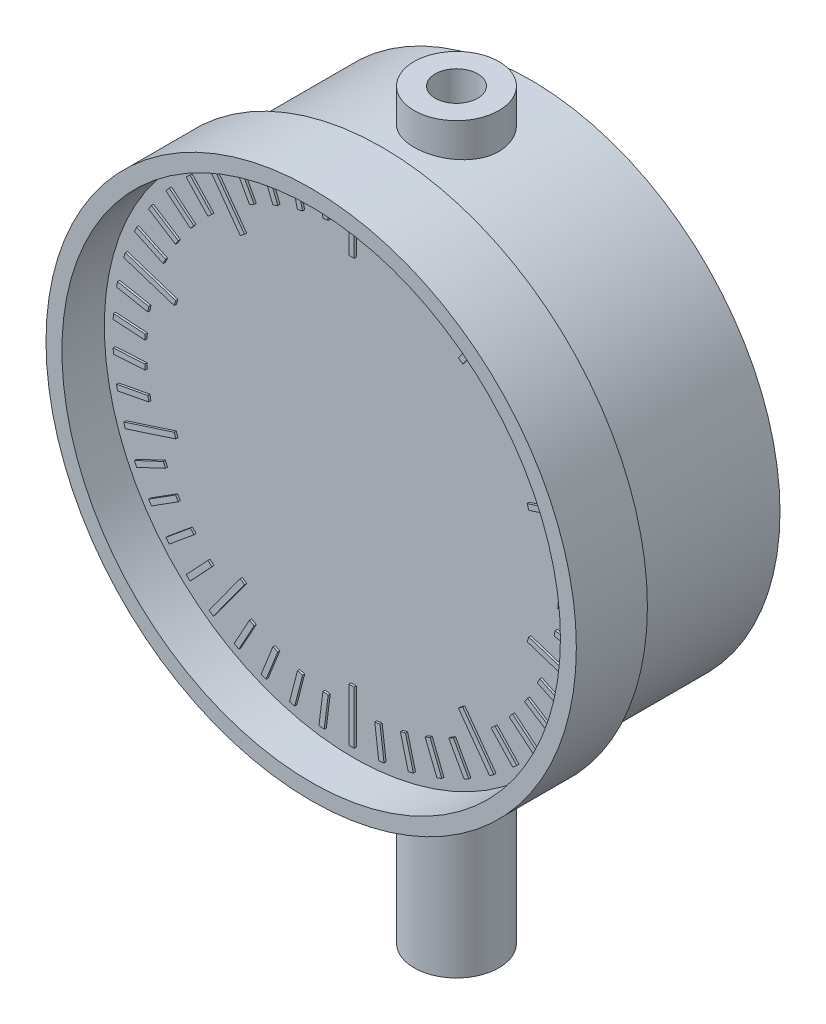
from build123d import *

# Parameters (mm, degrees)
SKIZZE1_R                            = 23.5
LINEAR_AUSTRAGEN1_DEPTH              = 14
SKIZZE1_3_R                          = 25
LINEAR_AUSTRAGEN2_DEPTH              = 6.7
SCHNITT_LINEAR_START                 = 6.7
SKIZZE1_4_R                          = 23.5
SCHNITT_LINEAR_AUSTRAGEN1_DEPTH      = 4
SCHNITT_LINEAR_AUSTRAGEN2_DEPTH      = 39.026306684
SCHNITT_LINEAR_AUSTRAGEN2_DEPTH_BACK = 39.026306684
SKIZZE8_R                            = 4
SKIZZE2_W                            = 2
SKIZZE2_H                            = 70
SKIZZE6_W                            = 0.5
SKIZZE6_H                            = 5.000396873
LINEAR_AUSTRAGEN3_DEPTH              = 0.2
LINEAR_AUSTRAGEN3_2_DEPTH            = 0.2
LINEAR_AUSTRAGEN3_3_DEPTH            = 0.2
LINEAR_AUSTRAGEN3_4_DEPTH            = 0.2
LINEAR_AUSTRAGEN3_5_DEPTH            = 0.2
KREISMUSTER1_COUNT                   = 10


with BuildPart() as part:
    # Skizze1 → Linear austragen1 (new body)
    with BuildSketch(Plane.XY):
        Circle(SKIZZE1_R)
    extrude(amount=-LINEAR_AUSTRAGEN1_DEPTH)

    # Skizze8 → Schnitt-Linear austragen2 (cut, two sides: drawn at the far end of the back side and taken through both)
    with BuildSketch(Plane(origin=(0, 0, 0), x_dir=(1, 0, 0), z_dir=(0, 1, 0)).offset(-SCHNITT_LINEAR_AUSTRAGEN2_DEPTH_BACK)):
        with Locations(Location((0, 7, 0), (0, 0, 270))):
            Circle(SKIZZE8_R)
    extrude(amount=SCHNITT_LINEAR_AUSTRAGEN2_DEPTH + SCHNITT_LINEAR_AUSTRAGEN2_DEPTH_BACK, mode=Mode.SUBTRACT)


with BuildPart() as body_2:
    # Skizze1_3 → Linear austragen2 (new body)
    with BuildSketch(Plane.XY):
        Circle(SKIZZE1_3_R)
    extrude(amount=LINEAR_AUSTRAGEN2_DEPTH)

    # Skizze1_4 → Schnitt-Linear austragen1 (cut)
    with BuildSketch(Plane.XY.offset(SCHNITT_LINEAR_START)):
        Circle(SKIZZE1_4_R)
    extrude(amount=-SCHNITT_LINEAR_AUSTRAGEN1_DEPTH, mode=Mode.SUBTRACT)


with BuildPart() as body_3:
    # Skizze2 → Rotation1 (revolve)
    with BuildSketch(Plane(origin=(0, 0, 0), x_dir=(0, 0, -1), z_dir=(1, 0, 0))):
        with Locations((4, -8.5)):
            Rectangle(SKIZZE2_W, SKIZZE2_H)
    revolve(axis=Axis((0, 29.980996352, -7), (0, -1, 0)))


with BuildPart() as body_4:
    # Skizze6 → Linear austragen3 (new body)
    with BuildSketch(Plane.XY.offset(2.7)):
        with Locations((0, 19.998412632)):
            Rectangle(SKIZZE6_W, SKIZZE6_H)
    linear_austragen3 = extrude(amount=LINEAR_AUSTRAGEN3_DEPTH)


with BuildPart() as body_5:
    # Skizze6 → Linear austragen3 2 (new body)
    with BuildSketch(Plane.XY.offset(2.7)):
        Polygon((3.067852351, 22.289869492), (2.691852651, 19.313525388), (2.1957953, 19.376192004), (2.571795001, 22.352536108), align=None)
    linear_austragen3_2 = extrude(amount=LINEAR_AUSTRAGEN3_2_DEPTH)


with BuildPart() as body_6:
    # Skizze6 → Linear austragen3 3 (new body)
    with BuildSketch(Plane.XY.offset(2.7)):
        Polygon((4.606961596, 18.948198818), (5.353031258, 21.853948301), (5.837322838, 21.729603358), (5.091253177, 18.823853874), align=None)
    linear_austragen3_3 = extrude(amount=LINEAR_AUSTRAGEN3_3_DEPTH)


with BuildPart() as body_7:
    # Skizze6 → Linear austragen3 4 (new body)
    with BuildSketch(Plane.XY.offset(2.7)):
        Polygon((6.945473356, 18.221381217), (8.049847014, 21.010710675), (8.514735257, 20.826648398), (7.410361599, 18.037318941), align=None)
    linear_austragen3_4 = extrude(amount=LINEAR_AUSTRAGEN3_4_DEPTH)


with BuildPart() as body_8:
    # Skizze6 → Linear austragen3 5 (new body)
    with BuildSketch(Plane.XY.offset(2.7)):
        Polygon((9.174450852, 17.207201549), (10.619711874, 19.836121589), (11.057865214, 19.595244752), (9.612604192, 16.966324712), align=None)
    linear_austragen3_5 = extrude(amount=LINEAR_AUSTRAGEN3_5_DEPTH)


with BuildPart() as body_2_1:
    add(body_2.part)

    # Kreismuster1: Linear austragen3, Linear austragen3 2, Linear austragen3 3, Linear austragen3 4, Linear austragen3 5 ×10 about axis
    kreismuster1_axis = Axis((0, 0, 0), (0, 0, 1))
    add([linear_austragen3.rotate(kreismuster1_axis, i * 360 / KREISMUSTER1_COUNT) for i in range(1, KREISMUSTER1_COUNT)])
    add([linear_austragen3_2.rotate(kreismuster1_axis, i * 360 / KREISMUSTER1_COUNT) for i in range(1, KREISMUSTER1_COUNT)])
    add([linear_austragen3_3.rotate(kreismuster1_axis, i * 360 / KREISMUSTER1_COUNT) for i in range(1, KREISMUSTER1_COUNT)])
    add([linear_austragen3_4.rotate(kreismuster1_axis, i * 360 / KREISMUSTER1_COUNT) for i in range(1, KREISMUSTER1_COUNT)])
    add([linear_austragen3_5.rotate(kreismuster1_axis, i * 360 / KREISMUSTER1_COUNT) for i in range(1, KREISMUSTER1_COUNT)])


solid = Compound([part.part, body_3.part, body_4.part, body_5.part, body_6.part, body_7.part, body_8.part, body_2_1.part])
